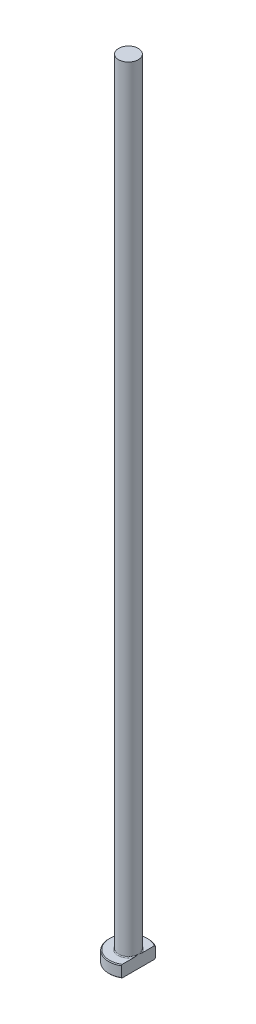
from build123d import *
from build123d.topology import SkipClean

# Parameters (mm, degrees)
CHAMFER1_SIZE = 0.2
FILLET1_R     = 0.2
KEY_DEPTH     = 201.124960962


with BuildPart() as part:
    # Sketch1 → Revolve1 (revolve)
    with BuildSketch(Plane.XY, mode=Mode.PRIVATE) as revolve1_sk:
        Polygon((0, 0), (-5, 0), (-5, 3), (-2.5, 3), (-2.5, 200), (0, 200), align=None)
    revolve(revolve1_sk.sketch.rotate(Axis((0, 259.958771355, 0), (0, -1, 0)), 270), axis=Axis((0, 259.958771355, 0), (0, -1, 0)))

    # Chamfer1
    chamfer1_edges = [part.edges().sort_by_distance(p)[0] for p in [
        (0, 3, -5),
        (0, 0, -5),
    ]]
    chamfer(chamfer1_edges, length=CHAMFER1_SIZE)

    # Fillet1
    fillet1_edges = [part.edges().sort_by_distance(p)[0] for p in [
        (0, 3, -2.5),
    ]]
    fillet(fillet1_edges, radius=FILLET1_R)

    # Sketch2 → KEY (cut, through all)
    with SkipClean():  # the faces are left unmerged after this step: merging them gives an invalid solid
        with BuildSketch(Plane(origin=(0, 0, 0), x_dir=(1, 0, 0), z_dir=(0, 1, 0))):
            with BuildLine():
                Line((2.5, 4.330127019), (2.5, -4.330127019))
                ThreePointArc((2.5, -4.330127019), (5, 0), (2.5, 4.330127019))
            make_face()
        extrude(amount=KEY_DEPTH, mode=Mode.SUBTRACT)


solid = part.part
